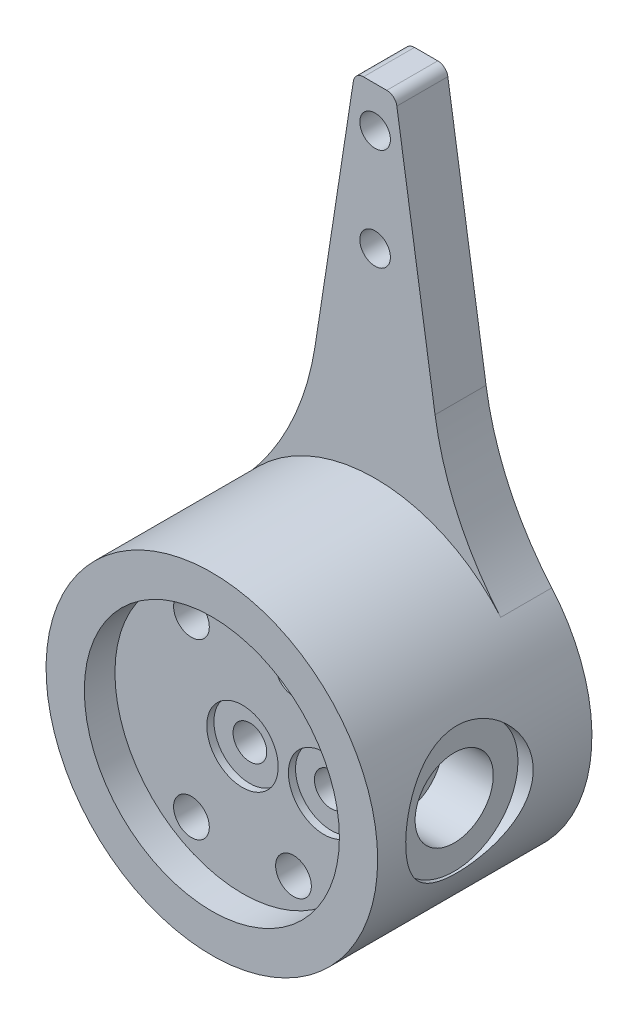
from build123d import *
from build123d.topology import SkipClean

# Parameters (mm, degrees)
ESQUISSE1_R          = 3
EXTRUSION1_DEPTH     = 10
CONG_1_R             = 2
ESQUISSE2_R          = 32.5
ESQUISSE2_R_2        = 3.5
EXTRUSION2_DEPTH     = 32
ESQUISSE4_R          = 5.5
EXTRUSION4_DEPTH     = 11
ESQUISSE5_R          = 25
EXTRUSION5_DEPTH     = 6
ESQUISSE6_R          = 7
EXTRUSION6_DEPTH     = 1.4
D_GAGEMENT_M61_D     = 6.6
D_GAGEMENT_M61_DEPTH = 17
D_GAGEMENT_M61_TIP   = 1.982840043
ESQUISSE9_R          = 12.5
EXTRUSION7_DEPTH     = 3
ESQUISSE10_R         = 7.6625
EXTRUSION8_DEPTH     = 10
ESQUISSE11_R         = 3.5
EXTRUSION9_DEPTH     = 3
EXTRUSION11_START    = 3
ESQUISSE12_R         = 12.5
EXTRUSION11_DEPTH    = 3
EXTRUSION12_START    = -11
ESQUISSE13_R         = 7.6625
EXTRUSION12_DEPTH    = 11
EXTRUSION13_START    = -17.5
ESQUISSE14_R         = 3.5
EXTRUSION13_DEPTH    = 17.5


with BuildPart() as part:
    # Esquisse1 → Extrusion1 (new body)
    with BuildSketch(Plane.XY):
        with BuildLine():
            Line((-11.749327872, 49.149249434), (-4, 99.5))
            Line((-4, 99.5), (4, 99.5))
            Line((4, 99.5), (11.749327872, 49.149249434))
            ThreePointArc((11.749327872, 49.149249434), (16.225038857, 34.274591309), (24.625883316, 21.208863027))
            ThreePointArc((24.625883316, 21.208863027), (0, -32.5), (-24.625883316, 21.208863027))
            ThreePointArc((-24.625883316, 21.208863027), (-16.225038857, 34.274591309), (-11.749327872, 49.149249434))
        make_face()
        with Locations((0, 91.5)):
            Circle(ESQUISSE1_R, mode=Mode.SUBTRACT)
        with Locations((0, 71.5)):
            Circle(ESQUISSE1_R, mode=Mode.SUBTRACT)
    extrude(amount=EXTRUSION1_DEPTH)

    # Cong_1
    cong_1_edges = [part.edges().sort_by_distance(p)[0] for p in [
        (-4, 99.5, 5),
        (4, 99.5, 5),
    ]]
    fillet(cong_1_edges, radius=CONG_1_R)

    # Esquisse2 → Extrusion2 (add)
    with SkipClean():  # the faces are left unmerged after this step: merging them gives an invalid solid
        with BuildSketch(Plane.XY.offset(10)):
            with Locations(Location((0, 0, 0), (0, 0, 139.26356325))):
                Circle(ESQUISSE2_R)
            with Locations((-10, 17)):
                Circle(ESQUISSE2_R_2, mode=Mode.SUBTRACT)
            with Locations((-10, -17)):
                Circle(ESQUISSE2_R_2, mode=Mode.SUBTRACT)
            with Locations(Location((10, -17, 0), (0, 0, 180))):
                Circle(ESQUISSE2_R_2, mode=Mode.SUBTRACT)
            with Locations(Location((10, 17, 0), (0, 0, 180))):
                Circle(ESQUISSE2_R_2, mode=Mode.SUBTRACT)
        extrude(amount=EXTRUSION2_DEPTH)

    # Esquisse4 → Extrusion4 (cut)
    with SkipClean():  # the faces are left unmerged after this step: merging them gives an invalid solid
        with BuildSketch(Plane(origin=(0, 0, 0), x_dir=(-1, 0, 0), z_dir=(0, 0, -1))):
            with Locations((-10, 17)):
                Circle(ESQUISSE4_R)
            with Locations((10, 17)):
                Circle(ESQUISSE4_R)
            with Locations((-10, -17)):
                Circle(ESQUISSE4_R)
            with Locations((10, -17)):
                Circle(ESQUISSE4_R)
        extrude(amount=-EXTRUSION4_DEPTH, mode=Mode.SUBTRACT)

    # Esquisse5 → Extrusion5 (cut)
    with SkipClean():  # the faces are left unmerged after this step: merging them gives an invalid solid
        with BuildSketch(Plane.XY.offset(42)):
            Circle(ESQUISSE5_R)
        extrude(amount=-EXTRUSION5_DEPTH, mode=Mode.SUBTRACT)

    # Esquisse6 → Extrusion6 (cut)
    with SkipClean():  # the faces are left unmerged after this step: merging them gives an invalid solid
        with BuildSketch(Plane.XY.offset(36)):
            Circle(ESQUISSE6_R)
            with Locations((16, 0)):
                Circle(ESQUISSE6_R)
        extrude(amount=-EXTRUSION6_DEPTH, mode=Mode.SUBTRACT)

    # D_gagement M61
    with Locations(Plane(origin=(16, 0, 34.6), x_dir=(1, 0, 0), z_dir=(0, 0, 1))):
        with Locations((0, 0), (-15.945309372, 0)):
            Hole(D_GAGEMENT_M61_D / 2, depth=D_GAGEMENT_M61_DEPTH)
            with Locations((0, 0, -(D_GAGEMENT_M61_DEPTH + D_GAGEMENT_M61_TIP / 2))):  # 118° drill point
                Cone(0, D_GAGEMENT_M61_D / 2, D_GAGEMENT_M61_TIP, mode=Mode.SUBTRACT)

    # Esquisse9 → Extrusion7 (cut)
    with SkipClean():  # the faces are left unmerged after this step: merging them gives an invalid solid
        with BuildSketch(Plane(origin=(32.5, 0, 20.9999875), x_dir=(0, -1, 0), z_dir=(1, 0, 0))):
            with Locations(Location((0, -3.0000125, 0), (0, 0, 180))):
                Circle(ESQUISSE9_R)
        extrude(amount=-EXTRUSION7_DEPTH, mode=Mode.SUBTRACT)

    # Esquisse10 → Extrusion8 (cut)
    with SkipClean():  # the faces are left unmerged after this step: merging them gives an invalid solid
        with BuildSketch(Plane(origin=(29.5, 0, 0), x_dir=(0, 0, -1), z_dir=(1, 0, 0))):
            with Locations(Location((-24, 0, 0), (0, 0, 90))):
                Circle(ESQUISSE10_R)
        extrude(amount=-EXTRUSION8_DEPTH, mode=Mode.SUBTRACT)

    # Esquisse11 → Extrusion9 (cut)
    with SkipClean():  # the faces are left unmerged after this step: merging them gives an invalid solid
        with BuildSketch(Plane(origin=(19.5, 0, 0), x_dir=(0, 0, -1), z_dir=(1, 0, 0))):
            with Locations(Location((-24, 0, 0), (0, 0, 90))):
                Circle(ESQUISSE11_R)
        extrude(amount=-EXTRUSION9_DEPTH, mode=Mode.SUBTRACT)

    # Esquisse12 → Extrusion11 (cut)
    with SkipClean():  # the faces are left unmerged after this step: merging them gives an invalid solid
        with BuildSketch(Plane(origin=(-32.5, 0, 0), x_dir=(0, 0, -1), z_dir=(1, 0, 0)).offset(EXTRUSION11_START)):
            with Locations(Location((-24, 0, 0), (0, 0, 90))):
                Circle(ESQUISSE12_R)
        extrude(amount=-EXTRUSION11_DEPTH, mode=Mode.SUBTRACT)

    # Esquisse13 → Extrusion12 (cut)
    with SkipClean():  # the faces are left unmerged after this step: merging them gives an invalid solid
        with BuildSketch(Plane.ZY.offset(29.5).offset(EXTRUSION12_START)):
            with Locations(Location((24, 0, 0), (0, 0, 90))):
                Circle(ESQUISSE13_R)
        extrude(amount=EXTRUSION12_DEPTH, mode=Mode.SUBTRACT)

    # Esquisse14 → Extrusion13 (cut)
    with SkipClean():  # the faces are left unmerged after this step: merging them gives an invalid solid
        with BuildSketch(Plane.ZY.offset(18.5).offset(EXTRUSION13_START)):
            with Locations(Location((24, 0, 0), (0, 0, 90))):
                Circle(ESQUISSE14_R)
        extrude(amount=EXTRUSION13_DEPTH, mode=Mode.SUBTRACT)


solid = part.part
